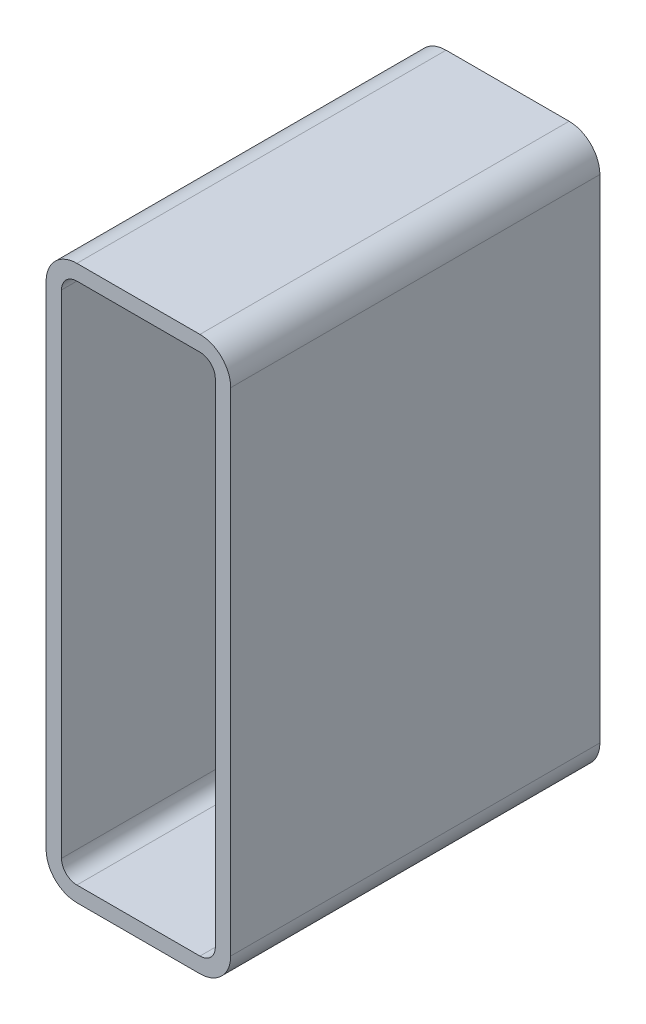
ISO-10303-21;
HEADER;
FILE_DESCRIPTION(('STEP AP214'),'2;1');
FILE_NAME('part.step','',(''),(''),'','','');
FILE_SCHEMA(('AUTOMOTIVE_DESIGN { 1 0 10303 214 1 1 1 1 }'));
ENDSEC;
DATA;
#1=APPLICATION_CONTEXT('core data for automotive mechanical design processes');
#2=APPLICATION_PROTOCOL_DEFINITION('international standard','automotive_design',2000,#1);
#3=PRODUCT_CONTEXT('',#1,'mechanical');
#4=PRODUCT('Part','Part','',(#3));
#5=PRODUCT_RELATED_PRODUCT_CATEGORY('part','',(#4));
#6=PRODUCT_DEFINITION_FORMATION('','',#4);
#7=PRODUCT_DEFINITION_CONTEXT('part definition',#1,'design');
#8=PRODUCT_DEFINITION('design','',#6,#7);
#9=PRODUCT_DEFINITION_SHAPE('','',#8);
#10=(LENGTH_UNIT() NAMED_UNIT(*) SI_UNIT(.MILLI.,.METRE.));
#11=(NAMED_UNIT(*) PLANE_ANGLE_UNIT() SI_UNIT($,.RADIAN.));
#12=(NAMED_UNIT(*) SI_UNIT($,.STERADIAN.) SOLID_ANGLE_UNIT());
#13=UNCERTAINTY_MEASURE_WITH_UNIT(LENGTH_MEASURE(1.E-05),#10,'distance_accuracy_value','');
#14=(GEOMETRIC_REPRESENTATION_CONTEXT(3) GLOBAL_UNCERTAINTY_ASSIGNED_CONTEXT((#13)) GLOBAL_UNIT_ASSIGNED_CONTEXT((#10,
#11,#12)) REPRESENTATION_CONTEXT('',''));
#15=CARTESIAN_POINT('',(0.,0.,0.));
#16=DIRECTION('',(0.,0.,1.));
#17=DIRECTION('',(1.,0.,0.));
#18=AXIS2_PLACEMENT_3D('',#15,#16,#17);
#19=CARTESIAN_POINT('',(25.4473013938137,433.537045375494,304.8));
#20=DIRECTION('',(0.,0.,1.));
#21=DIRECTION('',(1.,0.,0.));
#22=AXIS2_PLACEMENT_3D('',#19,#20,#21);
#23=PLANE('',#22);
#24=CARTESIAN_POINT('',(25.4473013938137,433.537045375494,304.8));
#25=DIRECTION('',(0.,0.,1.));
#26=DIRECTION('',(1.,0.,0.));
#27=AXIS2_PLACEMENT_3D('',#24,#25,#26);
#28=CIRCLE('',#27,25.4);
#29=CARTESIAN_POINT('',(25.4473013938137,458.937045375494,304.8));
#30=VERTEX_POINT('',#29);
#31=CARTESIAN_POINT('',(0.0473013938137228,433.537045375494,304.8));
#32=VERTEX_POINT('',#31);
#33=EDGE_CURVE('E211',#30,#32,#28,.T.);
#34=ORIENTED_EDGE('',*,*,#33,.T.);
#35=DIRECTION('',(0.,-1.,0.));
#36=VECTOR('',#35,1.);
#37=CARTESIAN_POINT('',(0.0473013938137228,27.1370453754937,304.8));
#38=LINE('',#37,#36);
#39=CARTESIAN_POINT('',(0.0473013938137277,27.1370453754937,304.8));
#40=VERTEX_POINT('',#39);
#41=EDGE_CURVE('E214',#32,#40,#38,.T.);
#42=ORIENTED_EDGE('',*,*,#41,.T.);
#43=CARTESIAN_POINT('',(25.4473013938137,27.1370453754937,304.8));
#44=DIRECTION('',(0.,0.,1.));
#45=DIRECTION('',(1.,0.,0.));
#46=AXIS2_PLACEMENT_3D('',#43,#44,#45);
#47=CIRCLE('',#46,25.4);
#48=CARTESIAN_POINT('',(25.4473013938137,1.73704537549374,304.8));
#49=VERTEX_POINT('',#48);
#50=EDGE_CURVE('E217',#40,#49,#47,.T.);
#51=ORIENTED_EDGE('',*,*,#50,.T.);
#52=DIRECTION('',(1.,0.,0.));
#53=VECTOR('',#52,1.);
#54=CARTESIAN_POINT('',(127.047301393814,1.73704537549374,304.8));
#55=LINE('',#54,#53);
#56=CARTESIAN_POINT('',(127.047301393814,1.73704537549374,304.8));
#57=VERTEX_POINT('',#56);
#58=EDGE_CURVE('E219',#49,#57,#55,.T.);
#59=ORIENTED_EDGE('',*,*,#58,.T.);
#60=CARTESIAN_POINT('',(127.047301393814,27.1370453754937,304.8));
#61=DIRECTION('',(0.,0.,1.));
#62=DIRECTION('',(1.,0.,0.));
#63=AXIS2_PLACEMENT_3D('',#60,#61,#62);
#64=CIRCLE('',#63,25.4);
#65=CARTESIAN_POINT('',(152.447301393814,27.1370453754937,304.8));
#66=VERTEX_POINT('',#65);
#67=EDGE_CURVE('E221',#57,#66,#64,.T.);
#68=ORIENTED_EDGE('',*,*,#67,.T.);
#69=DIRECTION('',(0.,1.,0.));
#70=VECTOR('',#69,1.);
#71=CARTESIAN_POINT('',(152.447301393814,433.537045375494,304.8));
#72=LINE('',#71,#70);
#73=CARTESIAN_POINT('',(152.447301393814,433.537045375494,304.8));
#74=VERTEX_POINT('',#73);
#75=EDGE_CURVE('E223',#66,#74,#72,.T.);
#76=ORIENTED_EDGE('',*,*,#75,.T.);
#77=CARTESIAN_POINT('',(127.047301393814,433.537045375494,304.8));
#78=DIRECTION('',(0.,0.,1.));
#79=DIRECTION('',(1.,0.,0.));
#80=AXIS2_PLACEMENT_3D('',#77,#78,#79);
#81=CIRCLE('',#80,25.4);
#82=CARTESIAN_POINT('',(127.047301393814,458.937045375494,304.8));
#83=VERTEX_POINT('',#82);
#84=EDGE_CURVE('E225',#74,#83,#81,.T.);
#85=ORIENTED_EDGE('',*,*,#84,.T.);
#86=DIRECTION('',(-1.,0.,0.));
#87=VECTOR('',#86,1.);
#88=CARTESIAN_POINT('',(25.4473013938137,458.937045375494,304.8));
#89=LINE('',#88,#87);
#90=EDGE_CURVE('E227',#83,#30,#89,.T.);
#91=ORIENTED_EDGE('',*,*,#90,.T.);
#92=EDGE_LOOP('',(#34,#42,#51,#59,#68,#76,#85,#91));
#93=FACE_BOUND('',#92,.T.);
#94=DIRECTION('',(0.,-1.,0.));
#95=VECTOR('',#94,1.);
#96=CARTESIAN_POINT('',(12.7473013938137,27.1370453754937,304.8));
#97=LINE('',#96,#95);
#98=CARTESIAN_POINT('',(12.7473013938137,433.537045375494,304.8));
#99=VERTEX_POINT('',#98);
#100=CARTESIAN_POINT('',(12.7473013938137,27.1370453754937,304.8));
#101=VERTEX_POINT('',#100);
#102=EDGE_CURVE('E154',#99,#101,#97,.T.);
#103=ORIENTED_EDGE('',*,*,#102,.F.);
#104=CARTESIAN_POINT('',(25.4473013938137,433.537045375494,304.8));
#105=DIRECTION('',(0.,0.,1.));
#106=DIRECTION('',(1.,0.,0.));
#107=AXIS2_PLACEMENT_3D('',#104,#105,#106);
#108=CIRCLE('',#107,12.7);
#109=CARTESIAN_POINT('',(25.4473013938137,446.237045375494,304.8));
#110=VERTEX_POINT('',#109);
#111=EDGE_CURVE('E146',#110,#99,#108,.T.);
#112=ORIENTED_EDGE('',*,*,#111,.F.);
#113=DIRECTION('',(-1.,0.,0.));
#114=VECTOR('',#113,1.);
#115=CARTESIAN_POINT('',(25.4473013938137,446.237045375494,304.8));
#116=LINE('',#115,#114);
#117=CARTESIAN_POINT('',(127.047301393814,446.237045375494,304.8));
#118=VERTEX_POINT('',#117);
#119=EDGE_CURVE('E179',#118,#110,#116,.T.);
#120=ORIENTED_EDGE('',*,*,#119,.F.);
#121=CARTESIAN_POINT('',(127.047301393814,433.537045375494,304.8));
#122=DIRECTION('',(0.,0.,1.));
#123=DIRECTION('',(1.,0.,0.));
#124=AXIS2_PLACEMENT_3D('',#121,#122,#123);
#125=CIRCLE('',#124,12.7);
#126=CARTESIAN_POINT('',(139.747301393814,433.537045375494,304.8));
#127=VERTEX_POINT('',#126);
#128=EDGE_CURVE('E177',#127,#118,#125,.T.);
#129=ORIENTED_EDGE('',*,*,#128,.F.);
#130=DIRECTION('',(0.,1.,0.));
#131=VECTOR('',#130,1.);
#132=CARTESIAN_POINT('',(139.747301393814,433.537045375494,304.8));
#133=LINE('',#132,#131);
#134=CARTESIAN_POINT('',(139.747301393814,27.1370453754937,304.8));
#135=VERTEX_POINT('',#134);
#136=EDGE_CURVE('E175',#135,#127,#133,.T.);
#137=ORIENTED_EDGE('',*,*,#136,.F.);
#138=CARTESIAN_POINT('',(127.047301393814,27.1370453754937,304.8));
#139=DIRECTION('',(0.,0.,1.));
#140=DIRECTION('',(1.,0.,0.));
#141=AXIS2_PLACEMENT_3D('',#138,#139,#140);
#142=CIRCLE('',#141,12.7);
#143=CARTESIAN_POINT('',(127.047301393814,14.4370453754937,304.8));
#144=VERTEX_POINT('',#143);
#145=EDGE_CURVE('E173',#144,#135,#142,.T.);
#146=ORIENTED_EDGE('',*,*,#145,.F.);
#147=DIRECTION('',(1.,0.,0.));
#148=VECTOR('',#147,1.);
#149=CARTESIAN_POINT('',(127.047301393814,14.4370453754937,304.8));
#150=LINE('',#149,#148);
#151=CARTESIAN_POINT('',(25.4473013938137,14.4370453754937,304.8));
#152=VERTEX_POINT('',#151);
#153=EDGE_CURVE('E169',#152,#144,#150,.T.);
#154=ORIENTED_EDGE('',*,*,#153,.F.);
#155=CARTESIAN_POINT('',(25.4473013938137,27.1370453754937,304.8));
#156=DIRECTION('',(0.,0.,1.));
#157=DIRECTION('',(1.,0.,0.));
#158=AXIS2_PLACEMENT_3D('',#155,#156,#157);
#159=CIRCLE('',#158,12.7);
#160=EDGE_CURVE('E167',#101,#152,#159,.T.);
#161=ORIENTED_EDGE('',*,*,#160,.F.);
#162=EDGE_LOOP('',(#103,#112,#120,#129,#137,#146,#154,#161));
#163=FACE_BOUND('',#162,.T.);
#164=ADVANCED_FACE('F33',(#93,#163),#23,.T.);
#165=CARTESIAN_POINT('',(25.4473013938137,433.537045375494,0.));
#166=DIRECTION('',(0.,0.,1.));
#167=DIRECTION('',(1.,0.,0.));
#168=AXIS2_PLACEMENT_3D('',#165,#166,#167);
#169=PLANE('',#168);
#170=CARTESIAN_POINT('',(25.4473013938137,433.537045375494,0.));
#171=DIRECTION('',(0.,0.,1.));
#172=DIRECTION('',(1.,0.,0.));
#173=AXIS2_PLACEMENT_3D('',#170,#171,#172);
#174=CIRCLE('',#173,25.4);
#175=CARTESIAN_POINT('',(25.4473013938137,458.937045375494,0.));
#176=VERTEX_POINT('',#175);
#177=CARTESIAN_POINT('',(0.0473013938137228,433.537045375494,0.));
#178=VERTEX_POINT('',#177);
#179=EDGE_CURVE('E162',#176,#178,#174,.T.);
#180=ORIENTED_EDGE('',*,*,#179,.F.);
#181=DIRECTION('',(-1.,0.,0.));
#182=VECTOR('',#181,1.);
#183=CARTESIAN_POINT('',(25.4473013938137,458.937045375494,0.));
#184=LINE('',#183,#182);
#185=CARTESIAN_POINT('',(127.047301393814,458.937045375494,0.));
#186=VERTEX_POINT('',#185);
#187=EDGE_CURVE('E215',#186,#176,#184,.T.);
#188=ORIENTED_EDGE('',*,*,#187,.F.);
#189=CARTESIAN_POINT('',(127.047301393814,433.537045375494,0.));
#190=DIRECTION('',(0.,0.,1.));
#191=DIRECTION('',(1.,0.,0.));
#192=AXIS2_PLACEMENT_3D('',#189,#190,#191);
#193=CIRCLE('',#192,25.4);
#194=CARTESIAN_POINT('',(152.447301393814,433.537045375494,0.));
#195=VERTEX_POINT('',#194);
#196=EDGE_CURVE('E242',#195,#186,#193,.T.);
#197=ORIENTED_EDGE('',*,*,#196,.F.);
#198=DIRECTION('',(0.,1.,0.));
#199=VECTOR('',#198,1.);
#200=CARTESIAN_POINT('',(152.447301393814,433.537045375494,0.));
#201=LINE('',#200,#199);
#202=CARTESIAN_POINT('',(152.447301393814,27.1370453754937,0.));
#203=VERTEX_POINT('',#202);
#204=EDGE_CURVE('E240',#203,#195,#201,.T.);
#205=ORIENTED_EDGE('',*,*,#204,.F.);
#206=CARTESIAN_POINT('',(127.047301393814,27.1370453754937,0.));
#207=DIRECTION('',(0.,0.,1.));
#208=DIRECTION('',(1.,0.,0.));
#209=AXIS2_PLACEMENT_3D('',#206,#207,#208);
#210=CIRCLE('',#209,25.4);
#211=CARTESIAN_POINT('',(127.047301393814,1.73704537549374,0.));
#212=VERTEX_POINT('',#211);
#213=EDGE_CURVE('E238',#212,#203,#210,.T.);
#214=ORIENTED_EDGE('',*,*,#213,.F.);
#215=DIRECTION('',(1.,0.,0.));
#216=VECTOR('',#215,1.);
#217=CARTESIAN_POINT('',(127.047301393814,1.73704537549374,0.));
#218=LINE('',#217,#216);
#219=CARTESIAN_POINT('',(25.4473013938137,1.73704537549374,0.));
#220=VERTEX_POINT('',#219);
#221=EDGE_CURVE('E236',#220,#212,#218,.T.);
#222=ORIENTED_EDGE('',*,*,#221,.F.);
#223=CARTESIAN_POINT('',(25.4473013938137,27.1370453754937,0.));
#224=DIRECTION('',(0.,0.,1.));
#225=DIRECTION('',(1.,0.,0.));
#226=AXIS2_PLACEMENT_3D('',#223,#224,#225);
#227=CIRCLE('',#226,25.4);
#228=CARTESIAN_POINT('',(0.0473013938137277,27.1370453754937,0.));
#229=VERTEX_POINT('',#228);
#230=EDGE_CURVE('E234',#229,#220,#227,.T.);
#231=ORIENTED_EDGE('',*,*,#230,.F.);
#232=DIRECTION('',(0.,-1.,0.));
#233=VECTOR('',#232,1.);
#234=CARTESIAN_POINT('',(0.0473013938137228,27.1370453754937,0.));
#235=LINE('',#234,#233);
#236=EDGE_CURVE('E232',#178,#229,#235,.T.);
#237=ORIENTED_EDGE('',*,*,#236,.F.);
#238=EDGE_LOOP('',(#180,#188,#197,#205,#214,#222,#231,#237));
#239=FACE_BOUND('',#238,.T.);
#240=CARTESIAN_POINT('',(25.4473013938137,433.537045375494,0.));
#241=DIRECTION('',(0.,0.,1.));
#242=DIRECTION('',(1.,0.,0.));
#243=AXIS2_PLACEMENT_3D('',#240,#241,#242);
#244=CIRCLE('',#243,12.7);
#245=CARTESIAN_POINT('',(25.4473013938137,446.237045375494,0.));
#246=VERTEX_POINT('',#245);
#247=CARTESIAN_POINT('',(12.7473013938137,433.537045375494,0.));
#248=VERTEX_POINT('',#247);
#249=EDGE_CURVE('E56',#246,#248,#244,.T.);
#250=ORIENTED_EDGE('',*,*,#249,.T.);
#251=DIRECTION('',(0.,-1.,0.));
#252=VECTOR('',#251,1.);
#253=CARTESIAN_POINT('',(12.7473013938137,27.1370453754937,0.));
#254=LINE('',#253,#252);
#255=CARTESIAN_POINT('',(12.7473013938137,27.1370453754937,0.));
#256=VERTEX_POINT('',#255);
#257=EDGE_CURVE('E161',#248,#256,#254,.T.);
#258=ORIENTED_EDGE('',*,*,#257,.T.);
#259=CARTESIAN_POINT('',(25.4473013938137,27.1370453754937,0.));
#260=DIRECTION('',(0.,0.,1.));
#261=DIRECTION('',(1.,0.,0.));
#262=AXIS2_PLACEMENT_3D('',#259,#260,#261);
#263=CIRCLE('',#262,12.7);
#264=CARTESIAN_POINT('',(25.4473013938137,14.4370453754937,0.));
#265=VERTEX_POINT('',#264);
#266=EDGE_CURVE('E183',#256,#265,#263,.T.);
#267=ORIENTED_EDGE('',*,*,#266,.T.);
#268=DIRECTION('',(1.,0.,0.));
#269=VECTOR('',#268,1.);
#270=CARTESIAN_POINT('',(127.047301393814,14.4370453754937,0.));
#271=LINE('',#270,#269);
#272=CARTESIAN_POINT('',(127.047301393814,14.4370453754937,0.));
#273=VERTEX_POINT('',#272);
#274=EDGE_CURVE('E186',#265,#273,#271,.T.);
#275=ORIENTED_EDGE('',*,*,#274,.T.);
#276=CARTESIAN_POINT('',(127.047301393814,27.1370453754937,0.));
#277=DIRECTION('',(0.,0.,1.));
#278=DIRECTION('',(1.,0.,0.));
#279=AXIS2_PLACEMENT_3D('',#276,#277,#278);
#280=CIRCLE('',#279,12.7);
#281=CARTESIAN_POINT('',(139.747301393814,27.1370453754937,0.));
#282=VERTEX_POINT('',#281);
#283=EDGE_CURVE('E189',#273,#282,#280,.T.);
#284=ORIENTED_EDGE('',*,*,#283,.T.);
#285=DIRECTION('',(0.,1.,0.));
#286=VECTOR('',#285,1.);
#287=CARTESIAN_POINT('',(139.747301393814,433.537045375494,0.));
#288=LINE('',#287,#286);
#289=CARTESIAN_POINT('',(139.747301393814,433.537045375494,0.));
#290=VERTEX_POINT('',#289);
#291=EDGE_CURVE('E192',#282,#290,#288,.T.);
#292=ORIENTED_EDGE('',*,*,#291,.T.);
#293=CARTESIAN_POINT('',(127.047301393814,433.537045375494,0.));
#294=DIRECTION('',(0.,0.,1.));
#295=DIRECTION('',(1.,0.,0.));
#296=AXIS2_PLACEMENT_3D('',#293,#294,#295);
#297=CIRCLE('',#296,12.7);
#298=CARTESIAN_POINT('',(127.047301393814,446.237045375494,0.));
#299=VERTEX_POINT('',#298);
#300=EDGE_CURVE('E195',#290,#299,#297,.T.);
#301=ORIENTED_EDGE('',*,*,#300,.T.);
#302=DIRECTION('',(-1.,0.,0.));
#303=VECTOR('',#302,1.);
#304=CARTESIAN_POINT('',(25.4473013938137,446.237045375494,0.));
#305=LINE('',#304,#303);
#306=EDGE_CURVE('E155',#299,#246,#305,.T.);
#307=ORIENTED_EDGE('',*,*,#306,.T.);
#308=EDGE_LOOP('',(#250,#258,#267,#275,#284,#292,#301,#307));
#309=FACE_BOUND('',#308,.T.);
#310=ADVANCED_FACE('F272',(#239,#309),#169,.F.);
#311=CARTESIAN_POINT('',(25.4473013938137,433.537045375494,304.8));
#312=DIRECTION('',(0.,0.,-1.));
#313=DIRECTION('',(-1.,0.,0.));
#314=AXIS2_PLACEMENT_3D('',#311,#312,#313);
#315=CYLINDRICAL_SURFACE('',#314,25.4);
#316=ORIENTED_EDGE('',*,*,#179,.T.);
#317=DIRECTION('',(0.,0.,-1.));
#318=VECTOR('',#317,1.);
#319=CARTESIAN_POINT('',(0.0473013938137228,433.537045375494,304.8));
#320=LINE('',#319,#318);
#321=EDGE_CURVE('E11',#32,#178,#320,.T.);
#322=ORIENTED_EDGE('',*,*,#321,.F.);
#323=ORIENTED_EDGE('',*,*,#33,.F.);
#324=DIRECTION('',(0.,0.,-1.));
#325=VECTOR('',#324,1.);
#326=CARTESIAN_POINT('',(25.4473013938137,458.937045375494,304.8));
#327=LINE('',#326,#325);
#328=EDGE_CURVE('E229',#30,#176,#327,.T.);
#329=ORIENTED_EDGE('',*,*,#328,.T.);
#330=EDGE_LOOP('',(#316,#322,#323,#329));
#331=FACE_BOUND('',#330,.T.);
#332=ADVANCED_FACE('F35',(#331),#315,.T.);
#333=CARTESIAN_POINT('',(0.0473013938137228,27.1370453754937,304.8));
#334=DIRECTION('',(1.,0.,0.));
#335=DIRECTION('',(0.,0.,-1.));
#336=AXIS2_PLACEMENT_3D('',#333,#334,#335);
#337=PLANE('',#336);
#338=ORIENTED_EDGE('',*,*,#236,.T.);
#339=DIRECTION('',(0.,0.,-1.));
#340=VECTOR('',#339,1.);
#341=CARTESIAN_POINT('',(0.0473013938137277,27.1370453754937,304.8));
#342=LINE('',#341,#340);
#343=EDGE_CURVE('E41',#40,#229,#342,.T.);
#344=ORIENTED_EDGE('',*,*,#343,.F.);
#345=ORIENTED_EDGE('',*,*,#41,.F.);
#346=ORIENTED_EDGE('',*,*,#321,.T.);
#347=EDGE_LOOP('',(#338,#344,#345,#346));
#348=FACE_BOUND('',#347,.T.);
#349=ADVANCED_FACE('F289',(#348),#337,.F.);
#350=CARTESIAN_POINT('',(25.4473013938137,27.1370453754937,304.8));
#351=DIRECTION('',(0.,0.,-1.));
#352=DIRECTION('',(-1.,0.,0.));
#353=AXIS2_PLACEMENT_3D('',#350,#351,#352);
#354=CYLINDRICAL_SURFACE('',#353,25.4);
#355=ORIENTED_EDGE('',*,*,#230,.T.);
#356=DIRECTION('',(0.,0.,-1.));
#357=VECTOR('',#356,1.);
#358=CARTESIAN_POINT('',(25.4473013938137,1.73704537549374,304.8));
#359=LINE('',#358,#357);
#360=EDGE_CURVE('E259',#49,#220,#359,.T.);
#361=ORIENTED_EDGE('',*,*,#360,.F.);
#362=ORIENTED_EDGE('',*,*,#50,.F.);
#363=ORIENTED_EDGE('',*,*,#343,.T.);
#364=EDGE_LOOP('',(#355,#361,#362,#363));
#365=FACE_BOUND('',#364,.T.);
#366=ADVANCED_FACE('F266',(#365),#354,.T.);
#367=CARTESIAN_POINT('',(127.047301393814,1.73704537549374,304.8));
#368=DIRECTION('',(0.,1.,0.));
#369=DIRECTION('',(0.,0.,1.));
#370=AXIS2_PLACEMENT_3D('',#367,#368,#369);
#371=PLANE('',#370);
#372=ORIENTED_EDGE('',*,*,#221,.T.);
#373=DIRECTION('',(0.,0.,-1.));
#374=VECTOR('',#373,1.);
#375=CARTESIAN_POINT('',(127.047301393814,1.73704537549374,304.8));
#376=LINE('',#375,#374);
#377=EDGE_CURVE('E256',#57,#212,#376,.T.);
#378=ORIENTED_EDGE('',*,*,#377,.F.);
#379=ORIENTED_EDGE('',*,*,#58,.F.);
#380=ORIENTED_EDGE('',*,*,#360,.T.);
#381=EDGE_LOOP('',(#372,#378,#379,#380));
#382=FACE_BOUND('',#381,.T.);
#383=ADVANCED_FACE('F278',(#382),#371,.F.);
#384=CARTESIAN_POINT('',(127.047301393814,27.1370453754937,304.8));
#385=DIRECTION('',(0.,0.,-1.));
#386=DIRECTION('',(-1.,0.,0.));
#387=AXIS2_PLACEMENT_3D('',#384,#385,#386);
#388=CYLINDRICAL_SURFACE('',#387,25.4);
#389=ORIENTED_EDGE('',*,*,#213,.T.);
#390=DIRECTION('',(0.,0.,-1.));
#391=VECTOR('',#390,1.);
#392=CARTESIAN_POINT('',(152.447301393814,27.1370453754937,304.8));
#393=LINE('',#392,#391);
#394=EDGE_CURVE('E253',#66,#203,#393,.T.);
#395=ORIENTED_EDGE('',*,*,#394,.F.);
#396=ORIENTED_EDGE('',*,*,#67,.F.);
#397=ORIENTED_EDGE('',*,*,#377,.T.);
#398=EDGE_LOOP('',(#389,#395,#396,#397));
#399=FACE_BOUND('',#398,.T.);
#400=ADVANCED_FACE('F282',(#399),#388,.T.);
#401=CARTESIAN_POINT('',(152.447301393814,433.537045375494,304.8));
#402=DIRECTION('',(-1.,0.,0.));
#403=DIRECTION('',(0.,0.,1.));
#404=AXIS2_PLACEMENT_3D('',#401,#402,#403);
#405=PLANE('',#404);
#406=ORIENTED_EDGE('',*,*,#204,.T.);
#407=DIRECTION('',(0.,0.,-1.));
#408=VECTOR('',#407,1.);
#409=CARTESIAN_POINT('',(152.447301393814,433.537045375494,304.8));
#410=LINE('',#409,#408);
#411=EDGE_CURVE('E250',#74,#195,#410,.T.);
#412=ORIENTED_EDGE('',*,*,#411,.F.);
#413=ORIENTED_EDGE('',*,*,#75,.F.);
#414=ORIENTED_EDGE('',*,*,#394,.T.);
#415=EDGE_LOOP('',(#406,#412,#413,#414));
#416=FACE_BOUND('',#415,.T.);
#417=ADVANCED_FACE('F302',(#416),#405,.F.);
#418=CARTESIAN_POINT('',(127.047301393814,433.537045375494,304.8));
#419=DIRECTION('',(0.,0.,-1.));
#420=DIRECTION('',(-1.,0.,0.));
#421=AXIS2_PLACEMENT_3D('',#418,#419,#420);
#422=CYLINDRICAL_SURFACE('',#421,25.4);
#423=ORIENTED_EDGE('',*,*,#196,.T.);
#424=DIRECTION('',(0.,0.,-1.));
#425=VECTOR('',#424,1.);
#426=CARTESIAN_POINT('',(127.047301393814,458.937045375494,304.8));
#427=LINE('',#426,#425);
#428=EDGE_CURVE('E247',#83,#186,#427,.T.);
#429=ORIENTED_EDGE('',*,*,#428,.F.);
#430=ORIENTED_EDGE('',*,*,#84,.F.);
#431=ORIENTED_EDGE('',*,*,#411,.T.);
#432=EDGE_LOOP('',(#423,#429,#430,#431));
#433=FACE_BOUND('',#432,.T.);
#434=ADVANCED_FACE('F300',(#433),#422,.T.);
#435=CARTESIAN_POINT('',(25.4473013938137,458.937045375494,304.8));
#436=DIRECTION('',(0.,-1.,0.));
#437=DIRECTION('',(0.,0.,-1.));
#438=AXIS2_PLACEMENT_3D('',#435,#436,#437);
#439=PLANE('',#438);
#440=ORIENTED_EDGE('',*,*,#187,.T.);
#441=ORIENTED_EDGE('',*,*,#328,.F.);
#442=ORIENTED_EDGE('',*,*,#90,.F.);
#443=ORIENTED_EDGE('',*,*,#428,.T.);
#444=EDGE_LOOP('',(#440,#441,#442,#443));
#445=FACE_BOUND('',#444,.T.);
#446=ADVANCED_FACE('F295',(#445),#439,.F.);
#447=CARTESIAN_POINT('',(25.4473013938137,433.537045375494,304.8));
#448=DIRECTION('',(0.,0.,-1.));
#449=DIRECTION('',(-1.,0.,0.));
#450=AXIS2_PLACEMENT_3D('',#447,#448,#449);
#451=CYLINDRICAL_SURFACE('',#450,12.7);
#452=ORIENTED_EDGE('',*,*,#249,.F.);
#453=DIRECTION('',(0.,0.,-1.));
#454=VECTOR('',#453,1.);
#455=CARTESIAN_POINT('',(25.4473013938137,446.237045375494,304.8));
#456=LINE('',#455,#454);
#457=EDGE_CURVE('E150',#110,#246,#456,.T.);
#458=ORIENTED_EDGE('',*,*,#457,.F.);
#459=ORIENTED_EDGE('',*,*,#111,.T.);
#460=DIRECTION('',(0.,0.,-1.));
#461=VECTOR('',#460,1.);
#462=CARTESIAN_POINT('',(12.7473013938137,433.537045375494,304.8));
#463=LINE('',#462,#461);
#464=EDGE_CURVE('E149',#99,#248,#463,.T.);
#465=ORIENTED_EDGE('',*,*,#464,.T.);
#466=EDGE_LOOP('',(#452,#458,#459,#465));
#467=FACE_BOUND('',#466,.T.);
#468=ADVANCED_FACE('F148',(#467),#451,.F.);
#469=CARTESIAN_POINT('',(12.7473013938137,27.1370453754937,304.8));
#470=DIRECTION('',(1.,0.,0.));
#471=DIRECTION('',(0.,0.,-1.));
#472=AXIS2_PLACEMENT_3D('',#469,#470,#471);
#473=PLANE('',#472);
#474=ORIENTED_EDGE('',*,*,#257,.F.);
#475=ORIENTED_EDGE('',*,*,#464,.F.);
#476=ORIENTED_EDGE('',*,*,#102,.T.);
#477=DIRECTION('',(0.,0.,-1.));
#478=VECTOR('',#477,1.);
#479=CARTESIAN_POINT('',(12.7473013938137,27.1370453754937,304.8));
#480=LINE('',#479,#478);
#481=EDGE_CURVE('E163',#101,#256,#480,.T.);
#482=ORIENTED_EDGE('',*,*,#481,.T.);
#483=EDGE_LOOP('',(#474,#475,#476,#482));
#484=FACE_BOUND('',#483,.T.);
#485=ADVANCED_FACE('F158',(#484),#473,.T.);
#486=CARTESIAN_POINT('',(25.4473013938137,27.1370453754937,304.8));
#487=DIRECTION('',(0.,0.,-1.));
#488=DIRECTION('',(-1.,0.,0.));
#489=AXIS2_PLACEMENT_3D('',#486,#487,#488);
#490=CYLINDRICAL_SURFACE('',#489,12.7);
#491=ORIENTED_EDGE('',*,*,#266,.F.);
#492=ORIENTED_EDGE('',*,*,#481,.F.);
#493=ORIENTED_EDGE('',*,*,#160,.T.);
#494=DIRECTION('',(0.,0.,-1.));
#495=VECTOR('',#494,1.);
#496=CARTESIAN_POINT('',(25.4473013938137,14.4370453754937,304.8));
#497=LINE('',#496,#495);
#498=EDGE_CURVE('E208',#152,#265,#497,.T.);
#499=ORIENTED_EDGE('',*,*,#498,.T.);
#500=EDGE_LOOP('',(#491,#492,#493,#499));
#501=FACE_BOUND('',#500,.T.);
#502=ADVANCED_FACE('F327',(#501),#490,.F.);
#503=CARTESIAN_POINT('',(127.047301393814,14.4370453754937,304.8));
#504=DIRECTION('',(0.,1.,0.));
#505=DIRECTION('',(0.,0.,1.));
#506=AXIS2_PLACEMENT_3D('',#503,#504,#505);
#507=PLANE('',#506);
#508=ORIENTED_EDGE('',*,*,#274,.F.);
#509=ORIENTED_EDGE('',*,*,#498,.F.);
#510=ORIENTED_EDGE('',*,*,#153,.T.);
#511=DIRECTION('',(0.,0.,-1.));
#512=VECTOR('',#511,1.);
#513=CARTESIAN_POINT('',(127.047301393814,14.4370453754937,304.8));
#514=LINE('',#513,#512);
#515=EDGE_CURVE('E206',#144,#273,#514,.T.);
#516=ORIENTED_EDGE('',*,*,#515,.T.);
#517=EDGE_LOOP('',(#508,#509,#510,#516));
#518=FACE_BOUND('',#517,.T.);
#519=ADVANCED_FACE('F331',(#518),#507,.T.);
#520=CARTESIAN_POINT('',(127.047301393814,27.1370453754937,304.8));
#521=DIRECTION('',(0.,0.,-1.));
#522=DIRECTION('',(-1.,0.,0.));
#523=AXIS2_PLACEMENT_3D('',#520,#521,#522);
#524=CYLINDRICAL_SURFACE('',#523,12.7);
#525=ORIENTED_EDGE('',*,*,#283,.F.);
#526=ORIENTED_EDGE('',*,*,#515,.F.);
#527=ORIENTED_EDGE('',*,*,#145,.T.);
#528=DIRECTION('',(0.,0.,-1.));
#529=VECTOR('',#528,1.);
#530=CARTESIAN_POINT('',(139.747301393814,27.1370453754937,304.8));
#531=LINE('',#530,#529);
#532=EDGE_CURVE('E204',#135,#282,#531,.T.);
#533=ORIENTED_EDGE('',*,*,#532,.T.);
#534=EDGE_LOOP('',(#525,#526,#527,#533));
#535=FACE_BOUND('',#534,.T.);
#536=ADVANCED_FACE('F337',(#535),#524,.F.);
#537=CARTESIAN_POINT('',(139.747301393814,433.537045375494,304.8));
#538=DIRECTION('',(-1.,0.,0.));
#539=DIRECTION('',(0.,0.,1.));
#540=AXIS2_PLACEMENT_3D('',#537,#538,#539);
#541=PLANE('',#540);
#542=ORIENTED_EDGE('',*,*,#291,.F.);
#543=ORIENTED_EDGE('',*,*,#532,.F.);
#544=ORIENTED_EDGE('',*,*,#136,.T.);
#545=DIRECTION('',(0.,0.,-1.));
#546=VECTOR('',#545,1.);
#547=CARTESIAN_POINT('',(139.747301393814,433.537045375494,304.8));
#548=LINE('',#547,#546);
#549=EDGE_CURVE('E202',#127,#290,#548,.T.);
#550=ORIENTED_EDGE('',*,*,#549,.T.);
#551=EDGE_LOOP('',(#542,#543,#544,#550));
#552=FACE_BOUND('',#551,.T.);
#553=ADVANCED_FACE('F341',(#552),#541,.T.);
#554=CARTESIAN_POINT('',(127.047301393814,433.537045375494,304.8));
#555=DIRECTION('',(0.,0.,-1.));
#556=DIRECTION('',(-1.,0.,0.));
#557=AXIS2_PLACEMENT_3D('',#554,#555,#556);
#558=CYLINDRICAL_SURFACE('',#557,12.7);
#559=ORIENTED_EDGE('',*,*,#300,.F.);
#560=ORIENTED_EDGE('',*,*,#549,.F.);
#561=ORIENTED_EDGE('',*,*,#128,.T.);
#562=DIRECTION('',(0.,0.,-1.));
#563=VECTOR('',#562,1.);
#564=CARTESIAN_POINT('',(127.047301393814,446.237045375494,304.8));
#565=LINE('',#564,#563);
#566=EDGE_CURVE('E48',#118,#299,#565,.T.);
#567=ORIENTED_EDGE('',*,*,#566,.T.);
#568=EDGE_LOOP('',(#559,#560,#561,#567));
#569=FACE_BOUND('',#568,.T.);
#570=ADVANCED_FACE('F345',(#569),#558,.F.);
#571=CARTESIAN_POINT('',(25.4473013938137,446.237045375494,304.8));
#572=DIRECTION('',(0.,-1.,0.));
#573=DIRECTION('',(0.,0.,-1.));
#574=AXIS2_PLACEMENT_3D('',#571,#572,#573);
#575=PLANE('',#574);
#576=ORIENTED_EDGE('',*,*,#306,.F.);
#577=ORIENTED_EDGE('',*,*,#566,.F.);
#578=ORIENTED_EDGE('',*,*,#119,.T.);
#579=ORIENTED_EDGE('',*,*,#457,.T.);
#580=EDGE_LOOP('',(#576,#577,#578,#579));
#581=FACE_BOUND('',#580,.T.);
#582=ADVANCED_FACE('F349',(#581),#575,.T.);
#583=CLOSED_SHELL('',(#164,#310,#332,#349,#366,#383,#400,#417,#434,#446,#468,#485,#502,#519,
#536,#553,#570,#582));
#584=MANIFOLD_SOLID_BREP('B2',#583);
#585=ADVANCED_BREP_SHAPE_REPRESENTATION('',(#18,#584),#14);
#586=SHAPE_DEFINITION_REPRESENTATION(#9,#585);
ENDSEC;
END-ISO-10303-21;
